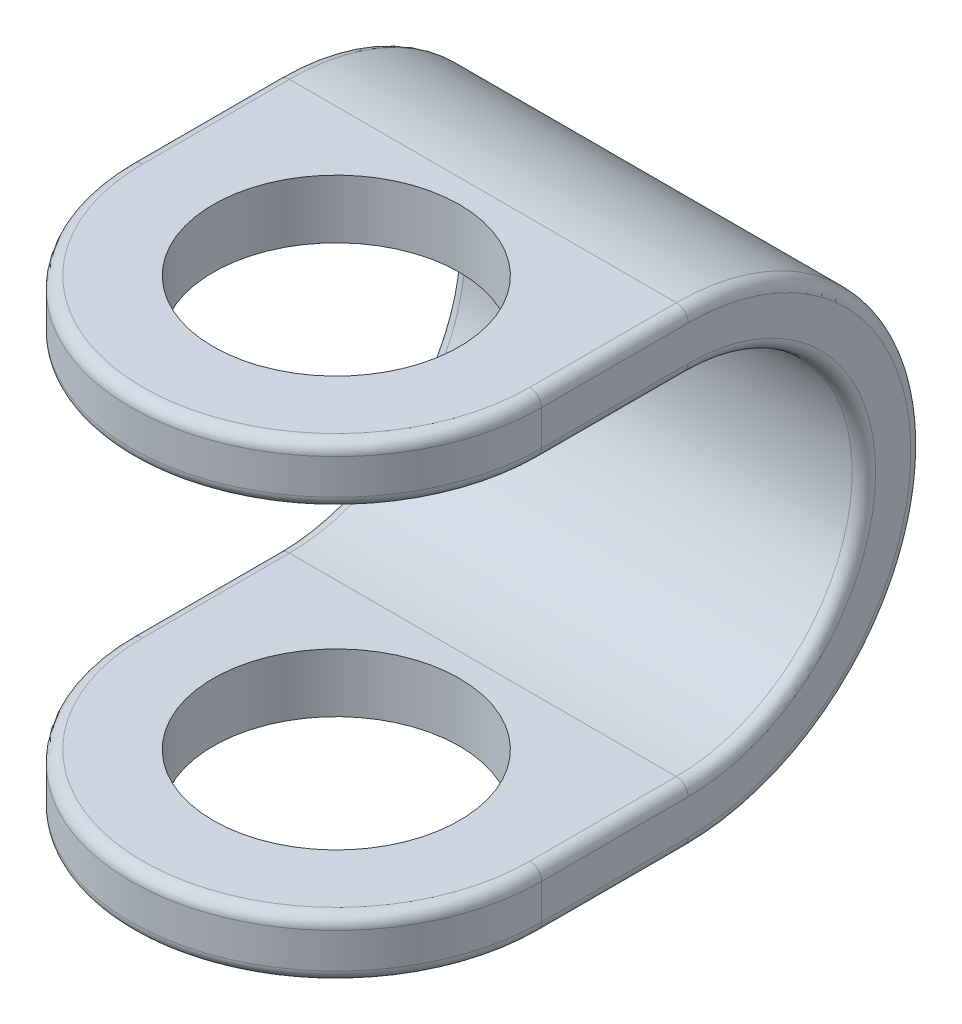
ISO-10303-21;
HEADER;
FILE_DESCRIPTION(('STEP AP214'),'2;1');
FILE_NAME('part.step','',(''),(''),'','','');
FILE_SCHEMA(('AUTOMOTIVE_DESIGN { 1 0 10303 214 1 1 1 1 }'));
ENDSEC;
DATA;
#1=APPLICATION_CONTEXT('core data for automotive mechanical design processes');
#2=APPLICATION_PROTOCOL_DEFINITION('international standard','automotive_design',2000,#1);
#3=PRODUCT_CONTEXT('',#1,'mechanical');
#4=PRODUCT('Part','Part','',(#3));
#5=PRODUCT_RELATED_PRODUCT_CATEGORY('part','',(#4));
#6=PRODUCT_DEFINITION_FORMATION('','',#4);
#7=PRODUCT_DEFINITION_CONTEXT('part definition',#1,'design');
#8=PRODUCT_DEFINITION('design','',#6,#7);
#9=PRODUCT_DEFINITION_SHAPE('','',#8);
#10=(LENGTH_UNIT() NAMED_UNIT(*) SI_UNIT(.MILLI.,.METRE.));
#11=(NAMED_UNIT(*) PLANE_ANGLE_UNIT() SI_UNIT($,.RADIAN.));
#12=(NAMED_UNIT(*) SI_UNIT($,.STERADIAN.) SOLID_ANGLE_UNIT());
#13=UNCERTAINTY_MEASURE_WITH_UNIT(LENGTH_MEASURE(1.E-05),#10,'distance_accuracy_value','');
#14=(GEOMETRIC_REPRESENTATION_CONTEXT(3) GLOBAL_UNCERTAINTY_ASSIGNED_CONTEXT((#13)) GLOBAL_UNIT_ASSIGNED_CONTEXT((#10,
#11,#12)) REPRESENTATION_CONTEXT('',''));
#15=CARTESIAN_POINT('',(0.,0.,0.));
#16=DIRECTION('',(0.,0.,1.));
#17=DIRECTION('',(1.,0.,0.));
#18=AXIS2_PLACEMENT_3D('',#15,#16,#17);
#19=CARTESIAN_POINT('',(-35.,80.,0.));
#20=DIRECTION('',(1.,0.,0.));
#21=DIRECTION('',(0.,0.,-1.));
#22=AXIS2_PLACEMENT_3D('',#19,#20,#21);
#23=PLANE('',#22);
#24=CARTESIAN_POINT('',(-35.,40.,-25.));
#25=DIRECTION('',(1.,0.,0.));
#26=DIRECTION('',(0.,0.,-1.));
#27=AXIS2_PLACEMENT_3D('',#24,#25,#26);
#28=CIRCLE('',#27,38.);
#29=CARTESIAN_POINT('',(-35.,78.,-25.));
#30=VERTEX_POINT('',#29);
#31=CARTESIAN_POINT('',(-35.,2.00000000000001,-25.));
#32=VERTEX_POINT('',#31);
#33=EDGE_CURVE('E214',#30,#32,#28,.F.);
#34=ORIENTED_EDGE('',*,*,#33,.T.);
#35=DIRECTION('',(0.,0.,1.));
#36=VECTOR('',#35,1.);
#37=CARTESIAN_POINT('',(-35.,2.,0.));
#38=LINE('',#37,#36);
#39=CARTESIAN_POINT('',(-35.,2.,0.));
#40=VERTEX_POINT('',#39);
#41=EDGE_CURVE('E177',#32,#40,#38,.T.);
#42=ORIENTED_EDGE('',*,*,#41,.T.);
#43=DIRECTION('',(0.,-1.,0.));
#44=VECTOR('',#43,1.);
#45=CARTESIAN_POINT('',(-35.,80.,0.));
#46=LINE('',#45,#44);
#47=CARTESIAN_POINT('',(-35.,8.,0.));
#48=VERTEX_POINT('',#47);
#49=EDGE_CURVE('E169',#48,#40,#46,.T.);
#50=ORIENTED_EDGE('',*,*,#49,.F.);
#51=DIRECTION('',(0.,0.,1.));
#52=VECTOR('',#51,1.);
#53=CARTESIAN_POINT('',(-35.,7.99999999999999,0.));
#54=LINE('',#53,#52);
#55=CARTESIAN_POINT('',(-35.,8.00000000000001,-25.));
#56=VERTEX_POINT('',#55);
#57=EDGE_CURVE('E154',#48,#56,#54,.F.);
#58=ORIENTED_EDGE('',*,*,#57,.T.);
#59=CARTESIAN_POINT('',(-35.,40.,-25.));
#60=DIRECTION('',(1.,0.,0.));
#61=DIRECTION('',(0.,0.,-1.));
#62=AXIS2_PLACEMENT_3D('',#59,#60,#61);
#63=CIRCLE('',#62,32.);
#64=CARTESIAN_POINT('',(-35.,72.,-25.));
#65=VERTEX_POINT('',#64);
#66=EDGE_CURVE('E162',#56,#65,#63,.T.);
#67=ORIENTED_EDGE('',*,*,#66,.T.);
#68=DIRECTION('',(0.,0.,1.));
#69=VECTOR('',#68,1.);
#70=CARTESIAN_POINT('',(-35.,72.,0.));
#71=LINE('',#70,#69);
#72=CARTESIAN_POINT('',(-35.,72.,0.));
#73=VERTEX_POINT('',#72);
#74=EDGE_CURVE('E210',#65,#73,#71,.T.);
#75=ORIENTED_EDGE('',*,*,#74,.T.);
#76=CARTESIAN_POINT('',(-35.,78.,0.));
#77=VERTEX_POINT('',#76);
#78=EDGE_CURVE('E178',#77,#73,#46,.T.);
#79=ORIENTED_EDGE('',*,*,#78,.F.);
#80=DIRECTION('',(0.,0.,1.));
#81=VECTOR('',#80,1.);
#82=CARTESIAN_POINT('',(-35.,78.,0.));
#83=LINE('',#82,#81);
#84=EDGE_CURVE('E161',#77,#30,#83,.F.);
#85=ORIENTED_EDGE('',*,*,#84,.T.);
#86=EDGE_LOOP('',(#34,#42,#50,#58,#67,#75,#79,#85));
#87=FACE_BOUND('',#86,.T.);
#88=ADVANCED_FACE('F28',(#87),#23,.F.);
#89=CARTESIAN_POINT('',(0.,80.,0.));
#90=DIRECTION('',(0.,-1.,0.));
#91=DIRECTION('',(0.,0.,-1.));
#92=AXIS2_PLACEMENT_3D('',#89,#90,#91);
#93=CYLINDRICAL_SURFACE('',#92,35.);
#94=ORIENTED_EDGE('',*,*,#49,.T.);
#95=CARTESIAN_POINT('',(0.,2.,0.));
#96=DIRECTION('',(0.,-1.,0.));
#97=DIRECTION('',(0.,0.,-1.));
#98=AXIS2_PLACEMENT_3D('',#95,#96,#97);
#99=CIRCLE('',#98,35.);
#100=CARTESIAN_POINT('',(35.,2.,0.));
#101=VERTEX_POINT('',#100);
#102=EDGE_CURVE('E173',#40,#101,#99,.F.);
#103=ORIENTED_EDGE('',*,*,#102,.T.);
#104=DIRECTION('',(0.,-1.,0.));
#105=VECTOR('',#104,1.);
#106=CARTESIAN_POINT('',(35.,80.,0.));
#107=LINE('',#106,#105);
#108=CARTESIAN_POINT('',(35.,8.,0.));
#109=VERTEX_POINT('',#108);
#110=EDGE_CURVE('E172',#109,#101,#107,.T.);
#111=ORIENTED_EDGE('',*,*,#110,.F.);
#112=CARTESIAN_POINT('',(0.,8.,0.));
#113=DIRECTION('',(0.,-1.,0.));
#114=DIRECTION('',(0.,0.,-1.));
#115=AXIS2_PLACEMENT_3D('',#112,#113,#114);
#116=CIRCLE('',#115,35.);
#117=EDGE_CURVE('E144',#109,#48,#116,.T.);
#118=ORIENTED_EDGE('',*,*,#117,.T.);
#119=EDGE_LOOP('',(#94,#103,#111,#118));
#120=FACE_BOUND('',#119,.T.);
#121=ADVANCED_FACE('F167',(#120),#93,.T.);
#122=CARTESIAN_POINT('',(217.43149399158,40.,-25.));
#123=DIRECTION('',(-1.,0.,0.));
#124=DIRECTION('',(0.,0.,1.));
#125=AXIS2_PLACEMENT_3D('',#122,#123,#124);
#126=CYLINDRICAL_SURFACE('',#125,40.);
#127=DIRECTION('',(-1.,0.,0.));
#128=VECTOR('',#127,1.);
#129=CARTESIAN_POINT('',(217.43149399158,0.,-25.));
#130=LINE('',#129,#128);
#131=CARTESIAN_POINT('',(33.,0.,-25.));
#132=VERTEX_POINT('',#131);
#133=CARTESIAN_POINT('',(-33.,0.,-25.));
#134=VERTEX_POINT('',#133);
#135=EDGE_CURVE('E174',#132,#134,#130,.T.);
#136=ORIENTED_EDGE('',*,*,#135,.T.);
#137=CARTESIAN_POINT('',(-33.,40.,-25.));
#138=DIRECTION('',(1.,0.,0.));
#139=DIRECTION('',(0.,0.,-1.));
#140=AXIS2_PLACEMENT_3D('',#137,#138,#139);
#141=CIRCLE('',#140,40.);
#142=CARTESIAN_POINT('',(-32.9999999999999,80.,-25.));
#143=VERTEX_POINT('',#142);
#144=EDGE_CURVE('E231',#134,#143,#141,.T.);
#145=ORIENTED_EDGE('',*,*,#144,.T.);
#146=DIRECTION('',(-1.,0.,0.));
#147=VECTOR('',#146,1.);
#148=CARTESIAN_POINT('',(217.43149399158,80.,-25.));
#149=LINE('',#148,#147);
#150=CARTESIAN_POINT('',(33.,80.,-25.));
#151=VERTEX_POINT('',#150);
#152=EDGE_CURVE('E179',#151,#143,#149,.T.);
#153=ORIENTED_EDGE('',*,*,#152,.F.);
#154=CARTESIAN_POINT('',(33.,40.,-25.));
#155=DIRECTION('',(-1.,0.,0.));
#156=DIRECTION('',(0.,0.,1.));
#157=AXIS2_PLACEMENT_3D('',#154,#155,#156);
#158=CIRCLE('',#157,40.);
#159=EDGE_CURVE('E229',#151,#132,#158,.T.);
#160=ORIENTED_EDGE('',*,*,#159,.T.);
#161=EDGE_LOOP('',(#136,#145,#153,#160));
#162=FACE_BOUND('',#161,.T.);
#163=ADVANCED_FACE('F352',(#162),#126,.T.);
#164=CARTESIAN_POINT('',(35.,80.,-65.));
#165=DIRECTION('',(-1.,0.,0.));
#166=DIRECTION('',(0.,0.,1.));
#167=AXIS2_PLACEMENT_3D('',#164,#165,#166);
#168=PLANE('',#167);
#169=ORIENTED_EDGE('',*,*,#110,.T.);
#170=DIRECTION('',(0.,0.,-1.));
#171=VECTOR('',#170,1.);
#172=CARTESIAN_POINT('',(35.,2.,-25.));
#173=LINE('',#172,#171);
#174=CARTESIAN_POINT('',(35.,2.00000000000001,-25.));
#175=VERTEX_POINT('',#174);
#176=EDGE_CURVE('E227',#101,#175,#173,.T.);
#177=ORIENTED_EDGE('',*,*,#176,.T.);
#178=CARTESIAN_POINT('',(35.,40.,-25.));
#179=DIRECTION('',(-1.,0.,0.));
#180=DIRECTION('',(0.,0.,1.));
#181=AXIS2_PLACEMENT_3D('',#178,#179,#180);
#182=CIRCLE('',#181,38.);
#183=CARTESIAN_POINT('',(35.,78.,-25.));
#184=VERTEX_POINT('',#183);
#185=EDGE_CURVE('E225',#175,#184,#182,.F.);
#186=ORIENTED_EDGE('',*,*,#185,.T.);
#187=DIRECTION('',(0.,0.,-1.));
#188=VECTOR('',#187,1.);
#189=CARTESIAN_POINT('',(35.,78.,-65.));
#190=LINE('',#189,#188);
#191=CARTESIAN_POINT('',(35.,78.,0.));
#192=VERTEX_POINT('',#191);
#193=EDGE_CURVE('E223',#184,#192,#190,.F.);
#194=ORIENTED_EDGE('',*,*,#193,.T.);
#195=CARTESIAN_POINT('',(35.,72.,0.));
#196=VERTEX_POINT('',#195);
#197=EDGE_CURVE('E187',#192,#196,#107,.T.);
#198=ORIENTED_EDGE('',*,*,#197,.T.);
#199=DIRECTION('',(0.,0.,-1.));
#200=VECTOR('',#199,1.);
#201=CARTESIAN_POINT('',(35.,72.,-25.));
#202=LINE('',#201,#200);
#203=CARTESIAN_POINT('',(35.,72.,-25.));
#204=VERTEX_POINT('',#203);
#205=EDGE_CURVE('E217',#196,#204,#202,.T.);
#206=ORIENTED_EDGE('',*,*,#205,.T.);
#207=CARTESIAN_POINT('',(35.,40.,-25.));
#208=DIRECTION('',(-1.,0.,0.));
#209=DIRECTION('',(0.,0.,1.));
#210=AXIS2_PLACEMENT_3D('',#207,#208,#209);
#211=CIRCLE('',#210,32.);
#212=CARTESIAN_POINT('',(35.,8.00000000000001,-25.));
#213=VERTEX_POINT('',#212);
#214=EDGE_CURVE('E219',#204,#213,#211,.T.);
#215=ORIENTED_EDGE('',*,*,#214,.T.);
#216=DIRECTION('',(0.,0.,-1.));
#217=VECTOR('',#216,1.);
#218=CARTESIAN_POINT('',(35.,7.99999999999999,-65.));
#219=LINE('',#218,#217);
#220=EDGE_CURVE('E221',#213,#109,#219,.F.);
#221=ORIENTED_EDGE('',*,*,#220,.T.);
#222=EDGE_LOOP('',(#169,#177,#186,#194,#198,#206,#215,#221));
#223=FACE_BOUND('',#222,.T.);
#224=ADVANCED_FACE('F255',(#223),#168,.F.);
#225=ORIENTED_EDGE('',*,*,#197,.F.);
#226=CARTESIAN_POINT('',(0.,78.,0.));
#227=DIRECTION('',(0.,-1.,0.));
#228=DIRECTION('',(0.,0.,-1.));
#229=AXIS2_PLACEMENT_3D('',#226,#227,#228);
#230=CIRCLE('',#229,35.);
#231=EDGE_CURVE('E11',#192,#77,#230,.T.);
#232=ORIENTED_EDGE('',*,*,#231,.T.);
#233=ORIENTED_EDGE('',*,*,#78,.T.);
#234=CARTESIAN_POINT('',(0.,72.,0.));
#235=DIRECTION('',(0.,-1.,0.));
#236=DIRECTION('',(0.,0.,-1.));
#237=AXIS2_PLACEMENT_3D('',#234,#235,#236);
#238=CIRCLE('',#237,35.);
#239=EDGE_CURVE('E36',#73,#196,#238,.F.);
#240=ORIENTED_EDGE('',*,*,#239,.T.);
#241=EDGE_LOOP('',(#225,#232,#233,#240));
#242=FACE_BOUND('',#241,.T.);
#243=ADVANCED_FACE('F30',(#242),#93,.T.);
#244=CARTESIAN_POINT('',(0.,80.,0.));
#245=DIRECTION('',(0.,-1.,0.));
#246=DIRECTION('',(0.,0.,-1.));
#247=AXIS2_PLACEMENT_3D('',#244,#245,#246);
#248=PLANE('',#247);
#249=ORIENTED_EDGE('',*,*,#152,.T.);
#250=DIRECTION('',(0.,0.,1.));
#251=VECTOR('',#250,1.);
#252=CARTESIAN_POINT('',(-33.,80.,0.));
#253=LINE('',#252,#251);
#254=CARTESIAN_POINT('',(-33.,80.,0.));
#255=VERTEX_POINT('',#254);
#256=EDGE_CURVE('E241',#143,#255,#253,.T.);
#257=ORIENTED_EDGE('',*,*,#256,.T.);
#258=CARTESIAN_POINT('',(0.,80.,0.));
#259=DIRECTION('',(0.,-1.,0.));
#260=DIRECTION('',(0.,0.,-1.));
#261=AXIS2_PLACEMENT_3D('',#258,#259,#260);
#262=CIRCLE('',#261,33.);
#263=CARTESIAN_POINT('',(33.,80.,0.));
#264=VERTEX_POINT('',#263);
#265=EDGE_CURVE('E237',#255,#264,#262,.F.);
#266=ORIENTED_EDGE('',*,*,#265,.T.);
#267=DIRECTION('',(0.,0.,-1.));
#268=VECTOR('',#267,1.);
#269=CARTESIAN_POINT('',(33.,80.,0.));
#270=LINE('',#269,#268);
#271=EDGE_CURVE('E239',#264,#151,#270,.T.);
#272=ORIENTED_EDGE('',*,*,#271,.T.);
#273=EDGE_LOOP('',(#249,#257,#266,#272));
#274=FACE_BOUND('',#273,.T.);
#275=CARTESIAN_POINT('',(0.,80.,0.));
#276=DIRECTION('',(0.,1.,0.));
#277=DIRECTION('',(0.,0.,1.));
#278=AXIS2_PLACEMENT_3D('',#275,#276,#277);
#279=CIRCLE('',#278,21.);
#280=CARTESIAN_POINT('',(0.,80.,21.));
#281=VERTEX_POINT('',#280);
#282=EDGE_CURVE('E309',#281,#281,#279,.T.);
#283=ORIENTED_EDGE('',*,*,#282,.F.);
#284=EDGE_LOOP('',(#283));
#285=FACE_BOUND('',#284,.T.);
#286=ADVANCED_FACE('F342',(#274,#285),#248,.F.);
#287=CARTESIAN_POINT('',(0.,0.,0.));
#288=DIRECTION('',(0.,-1.,0.));
#289=DIRECTION('',(0.,0.,-1.));
#290=AXIS2_PLACEMENT_3D('',#287,#288,#289);
#291=PLANE('',#290);
#292=CARTESIAN_POINT('',(0.,0.,0.));
#293=DIRECTION('',(0.,1.,0.));
#294=DIRECTION('',(0.,0.,1.));
#295=AXIS2_PLACEMENT_3D('',#292,#293,#294);
#296=CIRCLE('',#295,21.);
#297=CARTESIAN_POINT('',(0.,0.,21.));
#298=VERTEX_POINT('',#297);
#299=EDGE_CURVE('E195',#298,#298,#296,.T.);
#300=ORIENTED_EDGE('',*,*,#299,.T.);
#301=EDGE_LOOP('',(#300));
#302=FACE_BOUND('',#301,.T.);
#303=CARTESIAN_POINT('',(0.,0.,0.));
#304=DIRECTION('',(0.,-1.,0.));
#305=DIRECTION('',(0.,0.,-1.));
#306=AXIS2_PLACEMENT_3D('',#303,#304,#305);
#307=CIRCLE('',#306,33.);
#308=CARTESIAN_POINT('',(33.,0.,0.));
#309=VERTEX_POINT('',#308);
#310=CARTESIAN_POINT('',(-33.,0.,0.));
#311=VERTEX_POINT('',#310);
#312=EDGE_CURVE('E200',#309,#311,#307,.T.);
#313=ORIENTED_EDGE('',*,*,#312,.T.);
#314=DIRECTION('',(0.,0.,1.));
#315=VECTOR('',#314,1.);
#316=CARTESIAN_POINT('',(-33.,0.,-25.));
#317=LINE('',#316,#315);
#318=EDGE_CURVE('E203',#311,#134,#317,.F.);
#319=ORIENTED_EDGE('',*,*,#318,.T.);
#320=ORIENTED_EDGE('',*,*,#135,.F.);
#321=DIRECTION('',(0.,0.,-1.));
#322=VECTOR('',#321,1.);
#323=CARTESIAN_POINT('',(33.,0.,0.));
#324=LINE('',#323,#322);
#325=EDGE_CURVE('E198',#132,#309,#324,.F.);
#326=ORIENTED_EDGE('',*,*,#325,.T.);
#327=EDGE_LOOP('',(#313,#319,#320,#326));
#328=FACE_BOUND('',#327,.T.);
#329=ADVANCED_FACE('F334',(#302,#328),#291,.T.);
#330=CARTESIAN_POINT('',(217.43149399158,40.,-25.));
#331=DIRECTION('',(-1.,0.,0.));
#332=DIRECTION('',(0.,0.,1.));
#333=AXIS2_PLACEMENT_3D('',#330,#331,#332);
#334=CYLINDRICAL_SURFACE('',#333,30.);
#335=DIRECTION('',(1.,0.,0.));
#336=VECTOR('',#335,1.);
#337=CARTESIAN_POINT('',(0.,70.,-25.));
#338=LINE('',#337,#336);
#339=CARTESIAN_POINT('',(33.,70.,-25.));
#340=VERTEX_POINT('',#339);
#341=CARTESIAN_POINT('',(-33.,70.,-25.));
#342=VERTEX_POINT('',#341);
#343=EDGE_CURVE('E316',#340,#342,#338,.F.);
#344=ORIENTED_EDGE('',*,*,#343,.T.);
#345=CARTESIAN_POINT('',(-33.,40.,-25.));
#346=DIRECTION('',(1.,0.,0.));
#347=DIRECTION('',(0.,0.,-1.));
#348=AXIS2_PLACEMENT_3D('',#345,#346,#347);
#349=CIRCLE('',#348,30.);
#350=CARTESIAN_POINT('',(-32.9999999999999,10.,-25.));
#351=VERTEX_POINT('',#350);
#352=EDGE_CURVE('E235',#342,#351,#349,.F.);
#353=ORIENTED_EDGE('',*,*,#352,.T.);
#354=DIRECTION('',(-1.,0.,0.));
#355=VECTOR('',#354,1.);
#356=CARTESIAN_POINT('',(217.43149399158,10.,-25.));
#357=LINE('',#356,#355);
#358=CARTESIAN_POINT('',(33.,10.,-25.));
#359=VERTEX_POINT('',#358);
#360=EDGE_CURVE('E183',#359,#351,#357,.T.);
#361=ORIENTED_EDGE('',*,*,#360,.F.);
#362=CARTESIAN_POINT('',(33.,40.,-25.));
#363=DIRECTION('',(-1.,0.,0.));
#364=DIRECTION('',(0.,0.,1.));
#365=AXIS2_PLACEMENT_3D('',#362,#363,#364);
#366=CIRCLE('',#365,30.);
#367=EDGE_CURVE('E233',#359,#340,#366,.F.);
#368=ORIENTED_EDGE('',*,*,#367,.T.);
#369=EDGE_LOOP('',(#344,#353,#361,#368));
#370=FACE_BOUND('',#369,.T.);
#371=ADVANCED_FACE('F332',(#370),#334,.F.);
#372=CARTESIAN_POINT('',(0.,70.,0.));
#373=DIRECTION('',(0.,-1.,0.));
#374=DIRECTION('',(0.,0.,-1.));
#375=AXIS2_PLACEMENT_3D('',#372,#373,#374);
#376=PLANE('',#375);
#377=CARTESIAN_POINT('',(0.,70.,0.));
#378=DIRECTION('',(0.,-1.,0.));
#379=DIRECTION('',(0.,0.,-1.));
#380=AXIS2_PLACEMENT_3D('',#377,#378,#379);
#381=CIRCLE('',#380,21.);
#382=CARTESIAN_POINT('',(0.,70.,-21.));
#383=VERTEX_POINT('',#382);
#384=EDGE_CURVE('E194',#383,#383,#381,.T.);
#385=ORIENTED_EDGE('',*,*,#384,.F.);
#386=EDGE_LOOP('',(#385));
#387=FACE_BOUND('',#386,.T.);
#388=CARTESIAN_POINT('',(0.,70.,0.));
#389=DIRECTION('',(0.,-1.,0.));
#390=DIRECTION('',(0.,0.,-1.));
#391=AXIS2_PLACEMENT_3D('',#388,#389,#390);
#392=CIRCLE('',#391,33.);
#393=CARTESIAN_POINT('',(33.,70.,0.));
#394=VERTEX_POINT('',#393);
#395=CARTESIAN_POINT('',(-33.,70.,0.));
#396=VERTEX_POINT('',#395);
#397=EDGE_CURVE('E43',#394,#396,#392,.T.);
#398=ORIENTED_EDGE('',*,*,#397,.T.);
#399=DIRECTION('',(0.,0.,1.));
#400=VECTOR('',#399,1.);
#401=CARTESIAN_POINT('',(-33.,70.,-25.));
#402=LINE('',#401,#400);
#403=EDGE_CURVE('E245',#396,#342,#402,.F.);
#404=ORIENTED_EDGE('',*,*,#403,.T.);
#405=ORIENTED_EDGE('',*,*,#343,.F.);
#406=DIRECTION('',(0.,0.,-1.));
#407=VECTOR('',#406,1.);
#408=CARTESIAN_POINT('',(33.,70.,0.));
#409=LINE('',#408,#407);
#410=EDGE_CURVE('E48',#340,#394,#409,.F.);
#411=ORIENTED_EDGE('',*,*,#410,.T.);
#412=EDGE_LOOP('',(#398,#404,#405,#411));
#413=FACE_BOUND('',#412,.T.);
#414=ADVANCED_FACE('F331',(#387,#413),#376,.T.);
#415=CARTESIAN_POINT('',(0.,10.,0.));
#416=DIRECTION('',(0.,-1.,0.));
#417=DIRECTION('',(0.,0.,-1.));
#418=AXIS2_PLACEMENT_3D('',#415,#416,#417);
#419=PLANE('',#418);
#420=CARTESIAN_POINT('',(0.,10.,0.));
#421=DIRECTION('',(0.,-1.,0.));
#422=DIRECTION('',(0.,0.,-1.));
#423=AXIS2_PLACEMENT_3D('',#420,#421,#422);
#424=CIRCLE('',#423,21.);
#425=CARTESIAN_POINT('',(0.,10.,-21.));
#426=VERTEX_POINT('',#425);
#427=EDGE_CURVE('E192',#426,#426,#424,.T.);
#428=ORIENTED_EDGE('',*,*,#427,.T.);
#429=EDGE_LOOP('',(#428));
#430=FACE_BOUND('',#429,.T.);
#431=ORIENTED_EDGE('',*,*,#360,.T.);
#432=DIRECTION('',(0.,0.,1.));
#433=VECTOR('',#432,1.);
#434=CARTESIAN_POINT('',(-33.,10.,0.));
#435=LINE('',#434,#433);
#436=CARTESIAN_POINT('',(-33.,10.,0.));
#437=VERTEX_POINT('',#436);
#438=EDGE_CURVE('E208',#351,#437,#435,.T.);
#439=ORIENTED_EDGE('',*,*,#438,.T.);
#440=CARTESIAN_POINT('',(0.,10.,0.));
#441=DIRECTION('',(0.,-1.,0.));
#442=DIRECTION('',(0.,0.,-1.));
#443=AXIS2_PLACEMENT_3D('',#440,#441,#442);
#444=CIRCLE('',#443,33.);
#445=CARTESIAN_POINT('',(33.,10.,0.));
#446=VERTEX_POINT('',#445);
#447=EDGE_CURVE('E147',#437,#446,#444,.F.);
#448=ORIENTED_EDGE('',*,*,#447,.T.);
#449=DIRECTION('',(0.,0.,-1.));
#450=VECTOR('',#449,1.);
#451=CARTESIAN_POINT('',(33.,10.,0.));
#452=LINE('',#451,#450);
#453=EDGE_CURVE('E205',#446,#359,#452,.T.);
#454=ORIENTED_EDGE('',*,*,#453,.T.);
#455=EDGE_LOOP('',(#431,#439,#448,#454));
#456=FACE_BOUND('',#455,.T.);
#457=ADVANCED_FACE('F321',(#430,#456),#419,.F.);
#458=CARTESIAN_POINT('',(0.,0.,0.));
#459=DIRECTION('',(0.,1.,0.));
#460=DIRECTION('',(0.,0.,1.));
#461=AXIS2_PLACEMENT_3D('',#458,#459,#460);
#462=CYLINDRICAL_SURFACE('',#461,21.);
#463=ORIENTED_EDGE('',*,*,#299,.F.);
#464=EDGE_LOOP('',(#463));
#465=FACE_BOUND('',#464,.T.);
#466=ORIENTED_EDGE('',*,*,#427,.F.);
#467=EDGE_LOOP('',(#466));
#468=FACE_BOUND('',#467,.T.);
#469=ADVANCED_FACE('F365',(#465,#468),#462,.F.);
#470=ORIENTED_EDGE('',*,*,#384,.T.);
#471=EDGE_LOOP('',(#470));
#472=FACE_BOUND('',#471,.T.);
#473=ORIENTED_EDGE('',*,*,#282,.T.);
#474=EDGE_LOOP('',(#473));
#475=FACE_BOUND('',#474,.T.);
#476=ADVANCED_FACE('F371',(#472,#475),#462,.F.);
#477=CARTESIAN_POINT('',(0.,78.,0.));
#478=DIRECTION('',(0.,-1.,0.));
#479=DIRECTION('',(0.,0.,-1.));
#480=AXIS2_PLACEMENT_3D('',#477,#478,#479);
#481=TOROIDAL_SURFACE('',#480,33.,2.);
#482=CARTESIAN_POINT('',(33.,78.,0.));
#483=DIRECTION('',(0.,0.,-1.));
#484=DIRECTION('',(-1.,0.,0.));
#485=AXIS2_PLACEMENT_3D('',#482,#483,#484);
#486=CIRCLE('',#485,2.);
#487=EDGE_CURVE('E303',#264,#192,#486,.T.);
#488=ORIENTED_EDGE('',*,*,#487,.F.);
#489=ORIENTED_EDGE('',*,*,#265,.F.);
#490=CARTESIAN_POINT('',(-33.,78.,0.));
#491=DIRECTION('',(0.,0.,-1.));
#492=DIRECTION('',(-1.,0.,0.));
#493=AXIS2_PLACEMENT_3D('',#490,#491,#492);
#494=CIRCLE('',#493,2.);
#495=EDGE_CURVE('E306',#77,#255,#494,.T.);
#496=ORIENTED_EDGE('',*,*,#495,.F.);
#497=ORIENTED_EDGE('',*,*,#231,.F.);
#498=EDGE_LOOP('',(#488,#489,#496,#497));
#499=FACE_BOUND('',#498,.T.);
#500=ADVANCED_FACE('F377',(#499),#481,.T.);
#501=CARTESIAN_POINT('',(-33.,78.,0.));
#502=DIRECTION('',(0.,0.,1.));
#503=DIRECTION('',(1.,0.,0.));
#504=AXIS2_PLACEMENT_3D('',#501,#502,#503);
#505=CYLINDRICAL_SURFACE('',#504,2.);
#506=ORIENTED_EDGE('',*,*,#495,.T.);
#507=ORIENTED_EDGE('',*,*,#256,.F.);
#508=CARTESIAN_POINT('',(-33.,78.,-25.));
#509=DIRECTION('',(0.,0.,-1.));
#510=DIRECTION('',(-1.,0.,0.));
#511=AXIS2_PLACEMENT_3D('',#508,#509,#510);
#512=CIRCLE('',#511,2.);
#513=EDGE_CURVE('E300',#30,#143,#512,.T.);
#514=ORIENTED_EDGE('',*,*,#513,.F.);
#515=ORIENTED_EDGE('',*,*,#84,.F.);
#516=EDGE_LOOP('',(#506,#507,#514,#515));
#517=FACE_BOUND('',#516,.T.);
#518=ADVANCED_FACE('F382',(#517),#505,.T.);
#519=CARTESIAN_POINT('',(33.,78.,0.));
#520=DIRECTION('',(0.,0.,-1.));
#521=DIRECTION('',(-1.,0.,0.));
#522=AXIS2_PLACEMENT_3D('',#519,#520,#521);
#523=CYLINDRICAL_SURFACE('',#522,2.);
#524=ORIENTED_EDGE('',*,*,#487,.T.);
#525=ORIENTED_EDGE('',*,*,#193,.F.);
#526=CARTESIAN_POINT('',(33.,78.,-25.));
#527=DIRECTION('',(0.,0.,-1.));
#528=DIRECTION('',(-1.,0.,0.));
#529=AXIS2_PLACEMENT_3D('',#526,#527,#528);
#530=CIRCLE('',#529,2.);
#531=EDGE_CURVE('E297',#151,#184,#530,.T.);
#532=ORIENTED_EDGE('',*,*,#531,.F.);
#533=ORIENTED_EDGE('',*,*,#271,.F.);
#534=EDGE_LOOP('',(#524,#525,#532,#533));
#535=FACE_BOUND('',#534,.T.);
#536=ADVANCED_FACE('F386',(#535),#523,.T.);
#537=CARTESIAN_POINT('',(-33.,40.,-25.));
#538=DIRECTION('',(1.,0.,0.));
#539=DIRECTION('',(0.,0.,-1.));
#540=AXIS2_PLACEMENT_3D('',#537,#538,#539);
#541=TOROIDAL_SURFACE('',#540,38.,2.);
#542=ORIENTED_EDGE('',*,*,#513,.T.);
#543=ORIENTED_EDGE('',*,*,#144,.F.);
#544=CARTESIAN_POINT('',(-33.,2.00000000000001,-25.));
#545=DIRECTION('',(0.,0.,1.));
#546=DIRECTION('',(1.,0.,0.));
#547=AXIS2_PLACEMENT_3D('',#544,#545,#546);
#548=CIRCLE('',#547,2.);
#549=EDGE_CURVE('E294',#32,#134,#548,.T.);
#550=ORIENTED_EDGE('',*,*,#549,.F.);
#551=ORIENTED_EDGE('',*,*,#33,.F.);
#552=EDGE_LOOP('',(#542,#543,#550,#551));
#553=FACE_BOUND('',#552,.T.);
#554=ADVANCED_FACE('F390',(#553),#541,.T.);
#555=CARTESIAN_POINT('',(33.,40.,-25.));
#556=DIRECTION('',(-1.,0.,0.));
#557=DIRECTION('',(0.,0.,1.));
#558=AXIS2_PLACEMENT_3D('',#555,#556,#557);
#559=TOROIDAL_SURFACE('',#558,38.,2.);
#560=ORIENTED_EDGE('',*,*,#531,.T.);
#561=ORIENTED_EDGE('',*,*,#185,.F.);
#562=CARTESIAN_POINT('',(33.,2.00000000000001,-25.));
#563=DIRECTION('',(0.,0.,1.));
#564=DIRECTION('',(1.,0.,0.));
#565=AXIS2_PLACEMENT_3D('',#562,#563,#564);
#566=CIRCLE('',#565,2.);
#567=EDGE_CURVE('E291',#132,#175,#566,.T.);
#568=ORIENTED_EDGE('',*,*,#567,.F.);
#569=ORIENTED_EDGE('',*,*,#159,.F.);
#570=EDGE_LOOP('',(#560,#561,#568,#569));
#571=FACE_BOUND('',#570,.T.);
#572=ADVANCED_FACE('F394',(#571),#559,.T.);
#573=CARTESIAN_POINT('',(-33.,2.,0.));
#574=DIRECTION('',(0.,0.,-1.));
#575=DIRECTION('',(-1.,0.,0.));
#576=AXIS2_PLACEMENT_3D('',#573,#574,#575);
#577=CYLINDRICAL_SURFACE('',#576,2.);
#578=ORIENTED_EDGE('',*,*,#549,.T.);
#579=ORIENTED_EDGE('',*,*,#318,.F.);
#580=CARTESIAN_POINT('',(-33.,2.,0.));
#581=DIRECTION('',(0.,0.,1.));
#582=DIRECTION('',(1.,0.,0.));
#583=AXIS2_PLACEMENT_3D('',#580,#581,#582);
#584=CIRCLE('',#583,2.);
#585=EDGE_CURVE('E289',#40,#311,#584,.T.);
#586=ORIENTED_EDGE('',*,*,#585,.F.);
#587=ORIENTED_EDGE('',*,*,#41,.F.);
#588=EDGE_LOOP('',(#578,#579,#586,#587));
#589=FACE_BOUND('',#588,.T.);
#590=ADVANCED_FACE('F398',(#589),#577,.T.);
#591=CARTESIAN_POINT('',(33.,2.,-65.));
#592=DIRECTION('',(0.,0.,1.));
#593=DIRECTION('',(1.,0.,0.));
#594=AXIS2_PLACEMENT_3D('',#591,#592,#593);
#595=CYLINDRICAL_SURFACE('',#594,2.);
#596=ORIENTED_EDGE('',*,*,#567,.T.);
#597=ORIENTED_EDGE('',*,*,#176,.F.);
#598=CARTESIAN_POINT('',(33.,2.,0.));
#599=DIRECTION('',(0.,0.,1.));
#600=DIRECTION('',(1.,0.,0.));
#601=AXIS2_PLACEMENT_3D('',#598,#599,#600);
#602=CIRCLE('',#601,2.);
#603=EDGE_CURVE('E287',#309,#101,#602,.T.);
#604=ORIENTED_EDGE('',*,*,#603,.F.);
#605=ORIENTED_EDGE('',*,*,#325,.F.);
#606=EDGE_LOOP('',(#596,#597,#604,#605));
#607=FACE_BOUND('',#606,.T.);
#608=ADVANCED_FACE('F402',(#607),#595,.T.);
#609=CARTESIAN_POINT('',(0.,2.,0.));
#610=DIRECTION('',(0.,-1.,0.));
#611=DIRECTION('',(0.,0.,-1.));
#612=AXIS2_PLACEMENT_3D('',#609,#610,#611);
#613=TOROIDAL_SURFACE('',#612,33.,2.);
#614=ORIENTED_EDGE('',*,*,#585,.T.);
#615=ORIENTED_EDGE('',*,*,#312,.F.);
#616=ORIENTED_EDGE('',*,*,#603,.T.);
#617=ORIENTED_EDGE('',*,*,#102,.F.);
#618=EDGE_LOOP('',(#614,#615,#616,#617));
#619=FACE_BOUND('',#618,.T.);
#620=ADVANCED_FACE('F406',(#619),#613,.T.);
#621=CARTESIAN_POINT('',(0.,72.,0.));
#622=DIRECTION('',(0.,-1.,0.));
#623=DIRECTION('',(0.,0.,-1.));
#624=AXIS2_PLACEMENT_3D('',#621,#622,#623);
#625=TOROIDAL_SURFACE('',#624,33.,2.);
#626=CARTESIAN_POINT('',(33.,72.,0.));
#627=DIRECTION('',(0.,0.,-1.));
#628=DIRECTION('',(-1.,0.,0.));
#629=AXIS2_PLACEMENT_3D('',#626,#627,#628);
#630=CIRCLE('',#629,2.);
#631=EDGE_CURVE('E260',#196,#394,#630,.T.);
#632=ORIENTED_EDGE('',*,*,#631,.F.);
#633=ORIENTED_EDGE('',*,*,#239,.F.);
#634=CARTESIAN_POINT('',(-33.,72.,0.));
#635=DIRECTION('',(0.,0.,-1.));
#636=DIRECTION('',(-1.,0.,0.));
#637=AXIS2_PLACEMENT_3D('',#634,#635,#636);
#638=CIRCLE('',#637,2.);
#639=EDGE_CURVE('E263',#396,#73,#638,.T.);
#640=ORIENTED_EDGE('',*,*,#639,.F.);
#641=ORIENTED_EDGE('',*,*,#397,.F.);
#642=EDGE_LOOP('',(#632,#633,#640,#641));
#643=FACE_BOUND('',#642,.T.);
#644=ADVANCED_FACE('F261',(#643),#625,.T.);
#645=CARTESIAN_POINT('',(-33.,72.,0.));
#646=DIRECTION('',(0.,0.,-1.));
#647=DIRECTION('',(-1.,0.,0.));
#648=AXIS2_PLACEMENT_3D('',#645,#646,#647);
#649=CYLINDRICAL_SURFACE('',#648,2.);
#650=ORIENTED_EDGE('',*,*,#639,.T.);
#651=ORIENTED_EDGE('',*,*,#74,.F.);
#652=CARTESIAN_POINT('',(-33.,72.,-25.));
#653=DIRECTION('',(0.,0.,-1.));
#654=DIRECTION('',(-1.,0.,0.));
#655=AXIS2_PLACEMENT_3D('',#652,#653,#654);
#656=CIRCLE('',#655,2.);
#657=EDGE_CURVE('E264',#342,#65,#656,.T.);
#658=ORIENTED_EDGE('',*,*,#657,.F.);
#659=ORIENTED_EDGE('',*,*,#403,.F.);
#660=EDGE_LOOP('',(#650,#651,#658,#659));
#661=FACE_BOUND('',#660,.T.);
#662=ADVANCED_FACE('F329',(#661),#649,.T.);
#663=CARTESIAN_POINT('',(33.,72.,-65.));
#664=DIRECTION('',(0.,0.,1.));
#665=DIRECTION('',(1.,0.,0.));
#666=AXIS2_PLACEMENT_3D('',#663,#664,#665);
#667=CYLINDRICAL_SURFACE('',#666,2.);
#668=ORIENTED_EDGE('',*,*,#631,.T.);
#669=ORIENTED_EDGE('',*,*,#410,.F.);
#670=CARTESIAN_POINT('',(33.,72.,-25.));
#671=DIRECTION('',(0.,0.,-1.));
#672=DIRECTION('',(-1.,0.,0.));
#673=AXIS2_PLACEMENT_3D('',#670,#671,#672);
#674=CIRCLE('',#673,2.);
#675=EDGE_CURVE('E268',#204,#340,#674,.T.);
#676=ORIENTED_EDGE('',*,*,#675,.F.);
#677=ORIENTED_EDGE('',*,*,#205,.F.);
#678=EDGE_LOOP('',(#668,#669,#676,#677));
#679=FACE_BOUND('',#678,.T.);
#680=ADVANCED_FACE('F266',(#679),#667,.T.);
#681=CARTESIAN_POINT('',(-33.,40.,-25.));
#682=DIRECTION('',(1.,0.,0.));
#683=DIRECTION('',(0.,0.,-1.));
#684=AXIS2_PLACEMENT_3D('',#681,#682,#683);
#685=TOROIDAL_SURFACE('',#684,32.,2.);
#686=ORIENTED_EDGE('',*,*,#657,.T.);
#687=ORIENTED_EDGE('',*,*,#66,.F.);
#688=CARTESIAN_POINT('',(-33.,8.00000000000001,-25.));
#689=DIRECTION('',(0.,0.,1.));
#690=DIRECTION('',(1.,0.,0.));
#691=AXIS2_PLACEMENT_3D('',#688,#689,#690);
#692=CIRCLE('',#691,2.);
#693=EDGE_CURVE('E157',#351,#56,#692,.T.);
#694=ORIENTED_EDGE('',*,*,#693,.F.);
#695=ORIENTED_EDGE('',*,*,#352,.F.);
#696=EDGE_LOOP('',(#686,#687,#694,#695));
#697=FACE_BOUND('',#696,.T.);
#698=ADVANCED_FACE('F325',(#697),#685,.T.);
#699=CARTESIAN_POINT('',(33.,40.,-25.));
#700=DIRECTION('',(-1.,0.,0.));
#701=DIRECTION('',(0.,0.,1.));
#702=AXIS2_PLACEMENT_3D('',#699,#700,#701);
#703=TOROIDAL_SURFACE('',#702,32.,2.);
#704=ORIENTED_EDGE('',*,*,#675,.T.);
#705=ORIENTED_EDGE('',*,*,#367,.F.);
#706=CARTESIAN_POINT('',(33.,8.00000000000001,-25.));
#707=DIRECTION('',(0.,0.,1.));
#708=DIRECTION('',(1.,0.,0.));
#709=AXIS2_PLACEMENT_3D('',#706,#707,#708);
#710=CIRCLE('',#709,2.);
#711=EDGE_CURVE('E150',#213,#359,#710,.T.);
#712=ORIENTED_EDGE('',*,*,#711,.F.);
#713=ORIENTED_EDGE('',*,*,#214,.F.);
#714=EDGE_LOOP('',(#704,#705,#712,#713));
#715=FACE_BOUND('',#714,.T.);
#716=ADVANCED_FACE('F274',(#715),#703,.T.);
#717=CARTESIAN_POINT('',(-33.,8.,0.));
#718=DIRECTION('',(0.,0.,1.));
#719=DIRECTION('',(1.,0.,0.));
#720=AXIS2_PLACEMENT_3D('',#717,#718,#719);
#721=CYLINDRICAL_SURFACE('',#720,2.);
#722=ORIENTED_EDGE('',*,*,#693,.T.);
#723=ORIENTED_EDGE('',*,*,#57,.F.);
#724=CARTESIAN_POINT('',(-33.,8.,0.));
#725=DIRECTION('',(0.,0.,1.));
#726=DIRECTION('',(1.,0.,0.));
#727=AXIS2_PLACEMENT_3D('',#724,#725,#726);
#728=CIRCLE('',#727,2.);
#729=EDGE_CURVE('E140',#437,#48,#728,.T.);
#730=ORIENTED_EDGE('',*,*,#729,.F.);
#731=ORIENTED_EDGE('',*,*,#438,.F.);
#732=EDGE_LOOP('',(#722,#723,#730,#731));
#733=FACE_BOUND('',#732,.T.);
#734=ADVANCED_FACE('F155',(#733),#721,.T.);
#735=CARTESIAN_POINT('',(33.,8.,0.));
#736=DIRECTION('',(0.,0.,-1.));
#737=DIRECTION('',(-1.,0.,0.));
#738=AXIS2_PLACEMENT_3D('',#735,#736,#737);
#739=CYLINDRICAL_SURFACE('',#738,2.);
#740=ORIENTED_EDGE('',*,*,#711,.T.);
#741=ORIENTED_EDGE('',*,*,#453,.F.);
#742=CARTESIAN_POINT('',(33.,8.,0.));
#743=DIRECTION('',(0.,0.,1.));
#744=DIRECTION('',(1.,0.,0.));
#745=AXIS2_PLACEMENT_3D('',#742,#743,#744);
#746=CIRCLE('',#745,2.);
#747=EDGE_CURVE('E151',#109,#446,#746,.T.);
#748=ORIENTED_EDGE('',*,*,#747,.F.);
#749=ORIENTED_EDGE('',*,*,#220,.F.);
#750=EDGE_LOOP('',(#740,#741,#748,#749));
#751=FACE_BOUND('',#750,.T.);
#752=ADVANCED_FACE('F278',(#751),#739,.T.);
#753=CARTESIAN_POINT('',(0.,8.,0.));
#754=DIRECTION('',(0.,-1.,0.));
#755=DIRECTION('',(0.,0.,-1.));
#756=AXIS2_PLACEMENT_3D('',#753,#754,#755);
#757=TOROIDAL_SURFACE('',#756,33.,2.);
#758=ORIENTED_EDGE('',*,*,#729,.T.);
#759=ORIENTED_EDGE('',*,*,#117,.F.);
#760=ORIENTED_EDGE('',*,*,#747,.T.);
#761=ORIENTED_EDGE('',*,*,#447,.F.);
#762=EDGE_LOOP('',(#758,#759,#760,#761));
#763=FACE_BOUND('',#762,.T.);
#764=ADVANCED_FACE('F142',(#763),#757,.T.);
#765=CLOSED_SHELL('',(#88,#121,#163,#224,#243,#286,#329,#371,#414,#457,#469,#476,#500,#518,#536,
#554,#572,#590,#608,#620,#644,#662,#680,#698,#716,#734,#752,#764));
#766=MANIFOLD_SOLID_BREP('B2',#765);
#767=ADVANCED_BREP_SHAPE_REPRESENTATION('',(#18,#766),#14);
#768=SHAPE_DEFINITION_REPRESENTATION(#9,#767);
ENDSEC;
END-ISO-10303-21;
